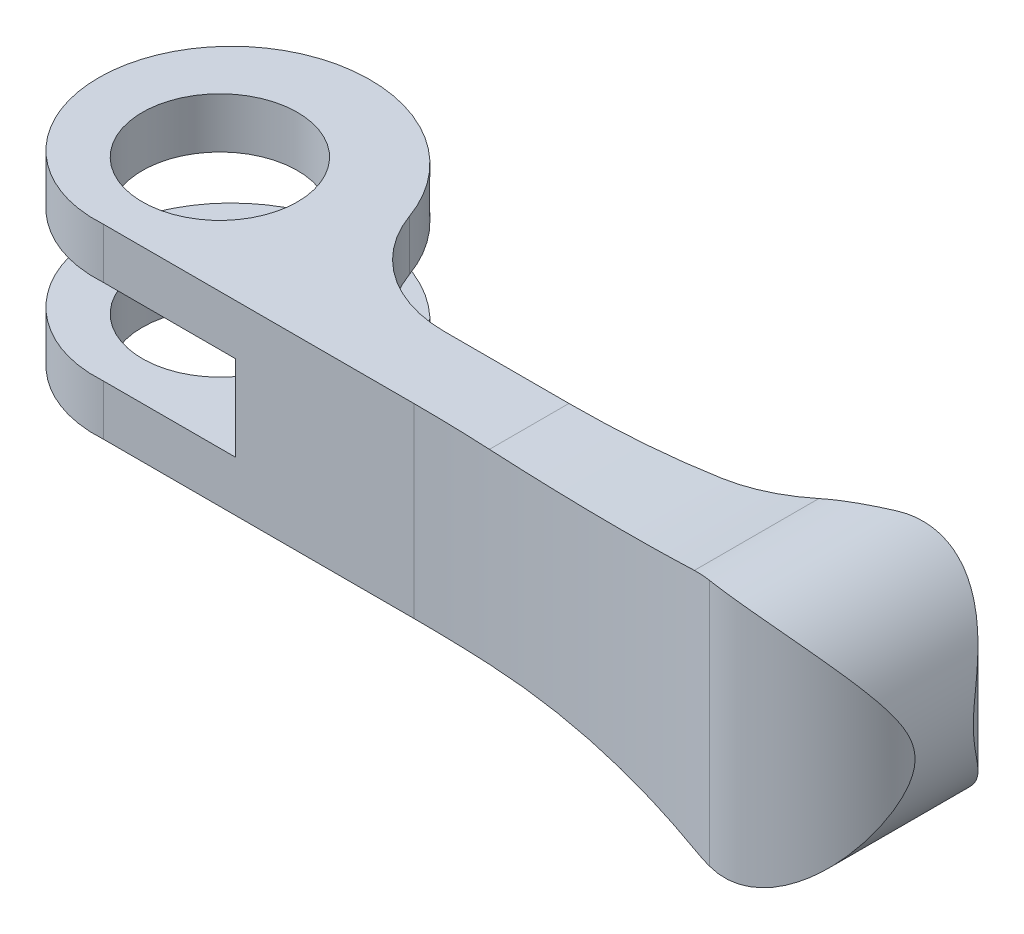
ISO-10303-21;
HEADER;
FILE_DESCRIPTION(('STEP AP214'),'2;1');
FILE_NAME('part.step','',(''),(''),'','','');
FILE_SCHEMA(('AUTOMOTIVE_DESIGN { 1 0 10303 214 1 1 1 1 }'));
ENDSEC;
DATA;
#1=APPLICATION_CONTEXT('core data for automotive mechanical design processes');
#2=APPLICATION_PROTOCOL_DEFINITION('international standard','automotive_design',2000,#1);
#3=PRODUCT_CONTEXT('',#1,'mechanical');
#4=PRODUCT('Part','Part','',(#3));
#5=PRODUCT_RELATED_PRODUCT_CATEGORY('part','',(#4));
#6=PRODUCT_DEFINITION_FORMATION('','',#4);
#7=PRODUCT_DEFINITION_CONTEXT('part definition',#1,'design');
#8=PRODUCT_DEFINITION('design','',#6,#7);
#9=PRODUCT_DEFINITION_SHAPE('','',#8);
#10=(LENGTH_UNIT() NAMED_UNIT(*) SI_UNIT(.MILLI.,.METRE.));
#11=(NAMED_UNIT(*) PLANE_ANGLE_UNIT() SI_UNIT($,.RADIAN.));
#12=(NAMED_UNIT(*) SI_UNIT($,.STERADIAN.) SOLID_ANGLE_UNIT());
#13=UNCERTAINTY_MEASURE_WITH_UNIT(LENGTH_MEASURE(1.E-05),#10,'distance_accuracy_value','');
#14=(GEOMETRIC_REPRESENTATION_CONTEXT(3) GLOBAL_UNCERTAINTY_ASSIGNED_CONTEXT((#13)) GLOBAL_UNIT_ASSIGNED_CONTEXT((#10,
#11,#12)) REPRESENTATION_CONTEXT('',''));
#15=CARTESIAN_POINT('',(0.,0.,0.));
#16=DIRECTION('',(0.,0.,1.));
#17=DIRECTION('',(1.,0.,0.));
#18=AXIS2_PLACEMENT_3D('',#15,#16,#17);
#19=CARTESIAN_POINT('',(20.,-8.,107.05));
#20=DIRECTION('',(0.,1.,0.));
#21=DIRECTION('',(1.,0.,0.));
#22=AXIS2_PLACEMENT_3D('',#19,#20,#21);
#23=CYLINDRICAL_SURFACE('',#22,99.55);
#24=CARTESIAN_POINT('',(40.1433447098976,7.7815699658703,9.55924062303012));
#25=CARTESIAN_POINT('',(40.2458941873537,7.80603937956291,9.58042855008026));
#26=CARTESIAN_POINT('',(40.3488715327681,7.82846573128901,9.60187471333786));
#27=CARTESIAN_POINT('',(40.5553761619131,7.86918752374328,9.64522558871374));
#28=CARTESIAN_POINT('',(40.6589023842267,7.88748913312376,9.66712956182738));
#29=CARTESIAN_POINT('',(40.9704289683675,7.93625939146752,9.73356333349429));
#30=CARTESIAN_POINT('',(41.1792613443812,7.96056586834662,9.7787910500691));
#31=CARTESIAN_POINT('',(41.3886034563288,7.97660292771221,9.82484820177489));
#32=B_SPLINE_CURVE_WITH_KNOTS('',3,(#24,#25,#26,#27,#28,#29,#30,#31),.UNSPECIFIED.,.F.,.F.,(4,2,
2,4),(0.,0.322577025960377,0.64466838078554,1.28921460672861),.UNSPECIFIED.);
#33=CARTESIAN_POINT('',(40.1433447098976,7.7815699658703,9.55924062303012));
#34=VERTEX_POINT('',#33);
#35=CARTESIAN_POINT('',(41.3886034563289,7.97660292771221,9.82484820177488));
#36=VERTEX_POINT('',#35);
#37=EDGE_CURVE('E179',#34,#36,#32,.T.);
#38=ORIENTED_EDGE('',*,*,#37,.F.);
#39=CARTESIAN_POINT('',(25.,6.,7.62564433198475));
#40=CARTESIAN_POINT('',(25.6432150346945,5.99999671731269,7.65798661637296));
#41=CARTESIAN_POINT('',(26.2860644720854,6.00951199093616,7.69657845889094));
#42=CARTESIAN_POINT('',(27.5703265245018,6.04748034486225,7.78617549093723));
#43=CARTESIAN_POINT('',(28.2117391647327,6.07593309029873,7.83718046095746));
#44=CARTESIAN_POINT('',(30.1265504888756,6.18917961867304,8.00813073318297));
#45=CARTESIAN_POINT('',(31.396810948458,6.30186449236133,8.14632916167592));
#46=CARTESIAN_POINT('',(33.9225081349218,6.60041769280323,8.47014726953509));
#47=CARTESIAN_POINT('',(35.1779454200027,6.78628325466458,8.65576515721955));
#48=CARTESIAN_POINT('',(37.0486962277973,7.11891974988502,8.96867057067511));
#49=CARTESIAN_POINT('',(37.6717158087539,7.23913092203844,9.07903027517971));
#50=CARTESIAN_POINT('',(38.9119872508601,7.49719375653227,9.31087118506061));
#51=CARTESIAN_POINT('',(39.5292392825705,7.63504489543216,9.43235206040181));
#52=CARTESIAN_POINT('',(40.1433447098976,7.7815699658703,9.55924062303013));
#53=B_SPLINE_CURVE_WITH_KNOTS('',3,(#39,#40,#41,#42,#43,#44,#45,#46,#47,#48,#49,#50,#51,#52),
.UNSPECIFIED.,.F.,.F.,(4,2,2,2,2,2,4),(0.,1.93188145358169,3.86372874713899,7.70857673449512,
11.5532794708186,13.4850725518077,15.416808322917),.UNSPECIFIED.);
#54=CARTESIAN_POINT('',(25.,6.,7.62564433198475));
#55=VERTEX_POINT('',#54);
#56=EDGE_CURVE('E145',#55,#34,#53,.T.);
#57=ORIENTED_EDGE('',*,*,#56,.F.);
#58=CARTESIAN_POINT('',(20.,6.,107.05));
#59=DIRECTION('',(0.,1.,0.));
#60=DIRECTION('',(1.,0.,0.));
#61=AXIS2_PLACEMENT_3D('',#58,#59,#60);
#62=CIRCLE('',#61,99.55);
#63=CARTESIAN_POINT('',(20.,6.,7.5));
#64=VERTEX_POINT('',#63);
#65=EDGE_CURVE('E154',#64,#55,#62,.F.);
#66=ORIENTED_EDGE('',*,*,#65,.F.);
#67=DIRECTION('',(0.,1.,0.));
#68=VECTOR('',#67,1.);
#69=CARTESIAN_POINT('',(20.,-8.,7.5));
#70=LINE('',#69,#68);
#71=CARTESIAN_POINT('',(20.,-6.,7.5));
#72=VERTEX_POINT('',#71);
#73=EDGE_CURVE('E301',#72,#64,#70,.T.);
#74=ORIENTED_EDGE('',*,*,#73,.F.);
#75=CARTESIAN_POINT('',(20.,-6.,107.05));
#76=DIRECTION('',(0.,1.,0.));
#77=DIRECTION('',(1.,0.,0.));
#78=AXIS2_PLACEMENT_3D('',#75,#76,#77);
#79=CIRCLE('',#78,99.55);
#80=CARTESIAN_POINT('',(25.,-6.,7.62564433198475));
#81=VERTEX_POINT('',#80);
#82=EDGE_CURVE('E522',#72,#81,#79,.F.);
#83=ORIENTED_EDGE('',*,*,#82,.T.);
#84=CARTESIAN_POINT('',(25.,-6.,7.62564433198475));
#85=CARTESIAN_POINT('',(25.6432150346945,-5.99999671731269,7.65798661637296));
#86=CARTESIAN_POINT('',(26.2860644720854,-6.00951199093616,7.69657845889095));
#87=CARTESIAN_POINT('',(27.5703265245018,-6.04748034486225,7.78617549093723));
#88=CARTESIAN_POINT('',(28.2117391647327,-6.07593309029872,7.83718046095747));
#89=CARTESIAN_POINT('',(30.1265504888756,-6.18917961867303,8.00813073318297));
#90=CARTESIAN_POINT('',(31.396810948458,-6.30186449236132,8.14632916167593));
#91=CARTESIAN_POINT('',(33.9225081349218,-6.60041769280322,8.4701472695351));
#92=CARTESIAN_POINT('',(35.1779454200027,-6.78628325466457,8.65576515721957));
#93=CARTESIAN_POINT('',(37.0486962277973,-7.11891974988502,8.96867057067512));
#94=CARTESIAN_POINT('',(37.6717158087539,-7.23913092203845,9.07903027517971));
#95=CARTESIAN_POINT('',(38.9119872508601,-7.49719375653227,9.3108711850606));
#96=CARTESIAN_POINT('',(39.5292392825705,-7.63504489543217,9.43235206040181));
#97=CARTESIAN_POINT('',(40.1433447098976,-7.78156996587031,9.55924062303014));
#98=B_SPLINE_CURVE_WITH_KNOTS('',3,(#84,#85,#86,#87,#88,#89,#90,#91,#92,#93,#94,#95,#96,#97),
.UNSPECIFIED.,.F.,.F.,(4,2,2,2,2,2,4),(0.,1.93188145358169,3.86372874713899,7.70857673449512,
11.5532794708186,13.4850725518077,15.416808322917),.UNSPECIFIED.);
#99=CARTESIAN_POINT('',(40.1433447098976,-7.7815699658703,9.55924062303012));
#100=VERTEX_POINT('',#99);
#101=EDGE_CURVE('E516',#81,#100,#98,.T.);
#102=ORIENTED_EDGE('',*,*,#101,.T.);
#103=CARTESIAN_POINT('',(40.1433447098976,-7.7815699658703,9.55924062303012));
#104=CARTESIAN_POINT('',(40.2458941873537,-7.80603937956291,9.58042855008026));
#105=CARTESIAN_POINT('',(40.3488715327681,-7.82846573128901,9.60187471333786));
#106=CARTESIAN_POINT('',(40.5553761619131,-7.86918752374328,9.64522558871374));
#107=CARTESIAN_POINT('',(40.6589023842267,-7.88748913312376,9.66712956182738));
#108=CARTESIAN_POINT('',(40.9704289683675,-7.93625939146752,9.73356333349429));
#109=CARTESIAN_POINT('',(41.1792613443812,-7.96056586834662,9.7787910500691));
#110=CARTESIAN_POINT('',(41.3886034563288,-7.97660292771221,9.82484820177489));
#111=B_SPLINE_CURVE_WITH_KNOTS('',3,(#103,#104,#105,#106,#107,#108,#109,#110),.UNSPECIFIED.,.F.,
.F.,(4,2,2,4),(0.,0.322577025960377,0.64466838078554,1.28921460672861),.UNSPECIFIED.);
#112=CARTESIAN_POINT('',(41.3886034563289,-7.97660292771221,9.82484820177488));
#113=VERTEX_POINT('',#112);
#114=EDGE_CURVE('E222',#100,#113,#111,.T.);
#115=ORIENTED_EDGE('',*,*,#114,.T.);
#116=DIRECTION('',(0.,1.,0.));
#117=VECTOR('',#116,1.);
#118=CARTESIAN_POINT('',(41.3886034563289,-8.,9.82484820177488));
#119=LINE('',#118,#117);
#120=EDGE_CURVE('E284',#113,#36,#119,.T.);
#121=ORIENTED_EDGE('',*,*,#120,.T.);
#122=EDGE_LOOP('',(#38,#57,#66,#74,#83,#102,#115,#121));
#123=FACE_BOUND('',#122,.T.);
#124=ADVANCED_FACE('F14',(#123),#23,.F.);
#125=CARTESIAN_POINT('',(0.,-8.,7.5));
#126=DIRECTION('',(0.,0.,-1.));
#127=DIRECTION('',(1.,0.,0.));
#128=AXIS2_PLACEMENT_3D('',#125,#126,#127);
#129=PLANE('',#128);
#130=DIRECTION('',(1.,0.,0.));
#131=VECTOR('',#130,1.);
#132=CARTESIAN_POINT('',(0.,6.,7.5));
#133=LINE('',#132,#131);
#134=CARTESIAN_POINT('',(0.,6.,7.5));
#135=VERTEX_POINT('',#134);
#136=EDGE_CURVE('E164',#135,#64,#133,.T.);
#137=ORIENTED_EDGE('',*,*,#136,.F.);
#138=DIRECTION('',(0.,1.,0.));
#139=VECTOR('',#138,1.);
#140=CARTESIAN_POINT('',(0.,-8.,7.5));
#141=LINE('',#140,#139);
#142=CARTESIAN_POINT('',(0.,2.75,7.5));
#143=VERTEX_POINT('',#142);
#144=EDGE_CURVE('E292',#143,#135,#141,.T.);
#145=ORIENTED_EDGE('',*,*,#144,.F.);
#146=DIRECTION('',(1.,0.,0.));
#147=VECTOR('',#146,1.);
#148=CARTESIAN_POINT('',(0.,2.75,7.5));
#149=LINE('',#148,#147);
#150=CARTESIAN_POINT('',(8.5,2.75,7.5));
#151=VERTEX_POINT('',#150);
#152=EDGE_CURVE('E42',#143,#151,#149,.T.);
#153=ORIENTED_EDGE('',*,*,#152,.T.);
#154=DIRECTION('',(0.,-1.,0.));
#155=VECTOR('',#154,1.);
#156=CARTESIAN_POINT('',(8.5,-8.,7.5));
#157=LINE('',#156,#155);
#158=CARTESIAN_POINT('',(8.5,-2.75,7.5));
#159=VERTEX_POINT('',#158);
#160=EDGE_CURVE('E365',#151,#159,#157,.T.);
#161=ORIENTED_EDGE('',*,*,#160,.T.);
#162=DIRECTION('',(-1.,0.,0.));
#163=VECTOR('',#162,1.);
#164=CARTESIAN_POINT('',(0.,-2.75,7.5));
#165=LINE('',#164,#163);
#166=CARTESIAN_POINT('',(0.,-2.75,7.5));
#167=VERTEX_POINT('',#166);
#168=EDGE_CURVE('E359',#159,#167,#165,.T.);
#169=ORIENTED_EDGE('',*,*,#168,.T.);
#170=CARTESIAN_POINT('',(0.,-6.,7.5));
#171=VERTEX_POINT('',#170);
#172=EDGE_CURVE('E296',#171,#167,#141,.T.);
#173=ORIENTED_EDGE('',*,*,#172,.F.);
#174=DIRECTION('',(1.,0.,0.));
#175=VECTOR('',#174,1.);
#176=CARTESIAN_POINT('',(0.,-6.,7.5));
#177=LINE('',#176,#175);
#178=EDGE_CURVE('E524',#171,#72,#177,.T.);
#179=ORIENTED_EDGE('',*,*,#178,.T.);
#180=ORIENTED_EDGE('',*,*,#73,.T.);
#181=EDGE_LOOP('',(#137,#145,#153,#161,#169,#173,#179,#180));
#182=FACE_BOUND('',#181,.T.);
#183=ADVANCED_FACE('F273',(#182),#129,.F.);
#184=CARTESIAN_POINT('',(0.,-8.,7.5));
#185=CARTESIAN_POINT('',(-0.98174770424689,-8.,7.56864583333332));
#186=CARTESIAN_POINT('',(-1.99074321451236,-8.,7.44195209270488));
#187=CARTESIAN_POINT('',(-3.90712600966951,-8.,6.79676377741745));
#188=CARTESIAN_POINT('',(-4.81367689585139,-8.,6.27832416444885));
#189=CARTESIAN_POINT('',(-6.37540403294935,-8.,4.91075676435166));
#190=CARTESIAN_POINT('',(-7.02981358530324,-8.,4.06201483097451));
#191=CARTESIAN_POINT('',(-7.96994804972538,-8.,2.15108987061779));
#192=CARTESIAN_POINT('',(-8.25510416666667,-8.,1.0895763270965));
#193=CARTESIAN_POINT('',(-8.39239583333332,-8.,-1.08957632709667));
#194=CARTESIAN_POINT('',(-8.2442620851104,-8.,-2.20635803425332));
#195=CARTESIAN_POINT('',(-7.51654531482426,-8.,-4.32198214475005));
#196=CARTESIAN_POINT('',(-6.93704972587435,-8.,-5.31990975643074));
#197=CARTESIAN_POINT('',(-5.41698962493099,-8.,-7.03412959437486));
#198=CARTESIAN_POINT('',(-4.47687096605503,-8.,-7.74959512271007));
#199=CARTESIAN_POINT('',(-2.36670469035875,-8.,-8.77225804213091));
#200=CARTESIAN_POINT('',(-1.19740494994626,-8.,-9.07885416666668));
#201=CARTESIAN_POINT('',(1.19740494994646,-8.,-9.21614583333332));
#202=CARTESIAN_POINT('',(2.42197285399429,-8.,-9.04657207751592));
#203=CARTESIAN_POINT('',(4.73683827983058,-8.,-8.23632685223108));
#204=CARTESIAN_POINT('',(5.82614261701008,-8.,-7.59577528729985));
#205=CARTESIAN_POINT('',(7.69285515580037,-8.,-5.92322248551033));
#206=CARTESIAN_POINT('',(8.46937666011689,-8.,-4.89172710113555));
#207=CARTESIAN_POINT('',(9.57456803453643,-8.,-2.5823195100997));
#208=CARTESIAN_POINT('',(9.90260416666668,-8.,-1.30523357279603));
#209=CARTESIAN_POINT('',(10.0398958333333,-8.,1.30523357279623));
#210=CARTESIAN_POINT('',(9.84888206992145,-8.,2.63758767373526));
#211=CARTESIAN_POINT('',(8.95610838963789,-8.,5.15169441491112));
#212=CARTESIAN_POINT('',(8.25450084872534,-8.,6.33237547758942));
#213=CARTESIAN_POINT('',(6.42945534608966,-8.,8.35158071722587));
#214=CARTESIAN_POINT('',(5.30658323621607,-8.,9.18915819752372));
#215=CARTESIAN_POINT('',(2.79793432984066,-8.,10.376878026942));
#216=CARTESIAN_POINT('',(1.4130621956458,-8.,10.7263541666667));
#217=CARTESIAN_POINT('',(-1.10427610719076E-13,-8.,10.795));
#218=B_SPLINE_CURVE_WITH_KNOTS('',3,(#184,#185,#186,#187,#188,#189,#190,#191,#192,#193,#194,
#195,#196,#197,#198,#199,#200,#201,#202,#203,#204,#205,#206,#207,#208,#209,#210,#211,#212,#213,
#214,#215,#216,#217),.UNSPECIFIED.,.F.,.F.,(4,2,2,2,2,2,2,2,2,2,2,2,2,2,2,2,4),(0.,0.0625,0.125,
0.1875,0.25,0.3125,0.375,0.4375,0.5,0.5625,0.625,0.6875,0.75,0.8125,0.875,0.9375,1.),.UNSPECIFIED.);
#219=DIRECTION('',(0.,1.,0.));
#220=VECTOR('',#219,1.);
#221=SURFACE_OF_LINEAR_EXTRUSION('',#218,#220);
#222=CARTESIAN_POINT('',(0.,6.,7.5));
#223=CARTESIAN_POINT('',(-0.98174770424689,6.,7.56864583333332));
#224=CARTESIAN_POINT('',(-1.99074321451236,6.,7.44195209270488));
#225=CARTESIAN_POINT('',(-3.90712600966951,6.,6.79676377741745));
#226=CARTESIAN_POINT('',(-4.81367689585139,6.,6.27832416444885));
#227=CARTESIAN_POINT('',(-6.37540403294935,6.,4.91075676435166));
#228=CARTESIAN_POINT('',(-7.02981358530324,6.,4.06201483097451));
#229=CARTESIAN_POINT('',(-7.96994804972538,6.,2.15108987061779));
#230=CARTESIAN_POINT('',(-8.25510416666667,6.,1.0895763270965));
#231=CARTESIAN_POINT('',(-8.39239583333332,6.,-1.08957632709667));
#232=CARTESIAN_POINT('',(-8.2442620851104,6.,-2.20635803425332));
#233=CARTESIAN_POINT('',(-7.51654531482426,6.,-4.32198214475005));
#234=CARTESIAN_POINT('',(-6.93704972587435,6.,-5.31990975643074));
#235=CARTESIAN_POINT('',(-5.41698962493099,6.,-7.03412959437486));
#236=CARTESIAN_POINT('',(-4.47687096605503,6.,-7.74959512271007));
#237=CARTESIAN_POINT('',(-2.36670469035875,6.,-8.77225804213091));
#238=CARTESIAN_POINT('',(-1.19740494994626,6.,-9.07885416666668));
#239=CARTESIAN_POINT('',(1.19740494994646,6.,-9.21614583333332));
#240=CARTESIAN_POINT('',(2.42197285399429,6.,-9.04657207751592));
#241=CARTESIAN_POINT('',(4.73683827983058,6.,-8.23632685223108));
#242=CARTESIAN_POINT('',(5.82614261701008,6.,-7.59577528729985));
#243=CARTESIAN_POINT('',(7.69285515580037,6.,-5.92322248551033));
#244=CARTESIAN_POINT('',(8.46937666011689,6.,-4.89172710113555));
#245=CARTESIAN_POINT('',(9.57456803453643,6.,-2.5823195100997));
#246=CARTESIAN_POINT('',(9.90260416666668,6.,-1.30523357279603));
#247=CARTESIAN_POINT('',(10.0398958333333,6.,1.30523357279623));
#248=CARTESIAN_POINT('',(9.84888206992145,6.,2.63758767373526));
#249=CARTESIAN_POINT('',(8.95610838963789,6.,5.15169441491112));
#250=CARTESIAN_POINT('',(8.25450084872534,6.,6.33237547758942));
#251=CARTESIAN_POINT('',(6.42945534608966,6.,8.35158071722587));
#252=CARTESIAN_POINT('',(5.30658323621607,6.,9.18915819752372));
#253=CARTESIAN_POINT('',(2.79793432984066,6.,10.376878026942));
#254=CARTESIAN_POINT('',(1.4130621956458,6.,10.7263541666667));
#255=CARTESIAN_POINT('',(-1.10427610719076E-13,6.,10.795));
#256=B_SPLINE_CURVE_WITH_KNOTS('',3,(#222,#223,#224,#225,#226,#227,#228,#229,#230,#231,#232,
#233,#234,#235,#236,#237,#238,#239,#240,#241,#242,#243,#244,#245,#246,#247,#248,#249,#250,#251,
#252,#253,#254,#255),.UNSPECIFIED.,.F.,.F.,(4,2,2,2,2,2,2,2,2,2,2,2,2,2,2,2,4),(0.,0.0625,0.125,
0.1875,0.25,0.3125,0.375,0.4375,0.5,0.5625,0.625,0.6875,0.75,0.8125,0.875,0.9375,1.),.UNSPECIFIED.);
#257=CARTESIAN_POINT('',(9.40828544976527,6.,-2.80915881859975));
#258=VERTEX_POINT('',#257);
#259=EDGE_CURVE('E162',#258,#135,#256,.F.);
#260=ORIENTED_EDGE('',*,*,#259,.F.);
#261=DIRECTION('',(0.,1.,0.));
#262=VECTOR('',#261,1.);
#263=CARTESIAN_POINT('',(9.40828544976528,8.,-2.80915881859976));
#264=LINE('',#263,#262);
#265=CARTESIAN_POINT('',(9.40828544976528,2.75,-2.80915881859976));
#266=VERTEX_POINT('',#265);
#267=EDGE_CURVE('E35',#258,#266,#264,.F.);
#268=ORIENTED_EDGE('',*,*,#267,.T.);
#269=CARTESIAN_POINT('',(0.,2.75,7.5));
#270=CARTESIAN_POINT('',(-0.98174770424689,2.75,7.56864583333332));
#271=CARTESIAN_POINT('',(-1.99074321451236,2.75,7.44195209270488));
#272=CARTESIAN_POINT('',(-3.90712600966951,2.75,6.79676377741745));
#273=CARTESIAN_POINT('',(-4.81367689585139,2.75,6.27832416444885));
#274=CARTESIAN_POINT('',(-6.37540403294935,2.75,4.91075676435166));
#275=CARTESIAN_POINT('',(-7.02981358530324,2.75,4.06201483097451));
#276=CARTESIAN_POINT('',(-7.96994804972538,2.75,2.15108987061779));
#277=CARTESIAN_POINT('',(-8.25510416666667,2.75,1.0895763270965));
#278=CARTESIAN_POINT('',(-8.39239583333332,2.75,-1.08957632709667));
#279=CARTESIAN_POINT('',(-8.2442620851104,2.75,-2.20635803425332));
#280=CARTESIAN_POINT('',(-7.51654531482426,2.75,-4.32198214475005));
#281=CARTESIAN_POINT('',(-6.93704972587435,2.75,-5.31990975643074));
#282=CARTESIAN_POINT('',(-5.41698962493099,2.75,-7.03412959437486));
#283=CARTESIAN_POINT('',(-4.47687096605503,2.75,-7.74959512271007));
#284=CARTESIAN_POINT('',(-2.36670469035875,2.75,-8.77225804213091));
#285=CARTESIAN_POINT('',(-1.19740494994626,2.75,-9.07885416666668));
#286=CARTESIAN_POINT('',(1.19740494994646,2.75,-9.21614583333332));
#287=CARTESIAN_POINT('',(2.42197285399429,2.75,-9.04657207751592));
#288=CARTESIAN_POINT('',(4.73683827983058,2.75,-8.23632685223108));
#289=CARTESIAN_POINT('',(5.82614261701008,2.75,-7.59577528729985));
#290=CARTESIAN_POINT('',(7.69285515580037,2.75,-5.92322248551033));
#291=CARTESIAN_POINT('',(8.46937666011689,2.75,-4.89172710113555));
#292=CARTESIAN_POINT('',(9.57456803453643,2.75,-2.5823195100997));
#293=CARTESIAN_POINT('',(9.90260416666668,2.75,-1.30523357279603));
#294=CARTESIAN_POINT('',(10.0398958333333,2.75,1.30523357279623));
#295=CARTESIAN_POINT('',(9.84888206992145,2.75,2.63758767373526));
#296=CARTESIAN_POINT('',(8.95610838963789,2.75,5.15169441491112));
#297=CARTESIAN_POINT('',(8.25450084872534,2.75,6.33237547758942));
#298=CARTESIAN_POINT('',(6.42945534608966,2.75,8.35158071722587));
#299=CARTESIAN_POINT('',(5.30658323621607,2.75,9.18915819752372));
#300=CARTESIAN_POINT('',(2.79793432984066,2.75,10.376878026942));
#301=CARTESIAN_POINT('',(1.4130621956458,2.75,10.7263541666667));
#302=CARTESIAN_POINT('',(-1.10427610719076E-13,2.75,10.795));
#303=B_SPLINE_CURVE_WITH_KNOTS('',3,(#269,#270,#271,#272,#273,#274,#275,#276,#277,#278,#279,
#280,#281,#282,#283,#284,#285,#286,#287,#288,#289,#290,#291,#292,#293,#294,#295,#296,#297,#298,
#299,#300,#301,#302),.UNSPECIFIED.,.F.,.F.,(4,2,2,2,2,2,2,2,2,2,2,2,2,2,2,2,4),(0.,0.0625,0.125,
0.1875,0.25,0.3125,0.375,0.4375,0.5,0.5625,0.625,0.6875,0.75,0.8125,0.875,0.9375,1.),.UNSPECIFIED.);
#304=EDGE_CURVE('E307',#266,#143,#303,.F.);
#305=ORIENTED_EDGE('',*,*,#304,.T.);
#306=ORIENTED_EDGE('',*,*,#144,.T.);
#307=EDGE_LOOP('',(#260,#268,#305,#306));
#308=FACE_BOUND('',#307,.T.);
#309=ADVANCED_FACE('F278',(#308),#221,.F.);
#310=CARTESIAN_POINT('',(9.7876235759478,-8.,2.5));
#311=DIRECTION('',(0.,0.,1.));
#312=DIRECTION('',(-1.,0.,0.));
#313=AXIS2_PLACEMENT_3D('',#310,#311,#312);
#314=PLANE('',#313);
#315=CARTESIAN_POINT('',(25.,71.25,2.5));
#316=DIRECTION('',(0.,0.,1.));
#317=DIRECTION('',(-1.,0.,0.));
#318=AXIS2_PLACEMENT_3D('',#315,#316,#317);
#319=CIRCLE('',#318,65.25);
#320=CARTESIAN_POINT('',(34.853251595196,6.7482486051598,2.5));
#321=VERTEX_POINT('',#320);
#322=CARTESIAN_POINT('',(25.,6.,2.5));
#323=VERTEX_POINT('',#322);
#324=EDGE_CURVE('E134',#321,#323,#319,.F.);
#325=ORIENTED_EDGE('',*,*,#324,.F.);
#326=DIRECTION('',(0.,1.,0.));
#327=VECTOR('',#326,1.);
#328=CARTESIAN_POINT('',(34.853251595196,-8.,2.5));
#329=LINE('',#328,#327);
#330=CARTESIAN_POINT('',(34.853251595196,-6.74824860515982,2.5));
#331=VERTEX_POINT('',#330);
#332=EDGE_CURVE('E288',#331,#321,#329,.T.);
#333=ORIENTED_EDGE('',*,*,#332,.F.);
#334=CARTESIAN_POINT('',(25.,-71.25,2.5));
#335=DIRECTION('',(0.,0.,1.));
#336=DIRECTION('',(-1.,0.,0.));
#337=AXIS2_PLACEMENT_3D('',#334,#335,#336);
#338=CIRCLE('',#337,65.25);
#339=CARTESIAN_POINT('',(25.,-6.,2.5));
#340=VERTEX_POINT('',#339);
#341=EDGE_CURVE('E257',#331,#340,#338,.T.);
#342=ORIENTED_EDGE('',*,*,#341,.T.);
#343=DIRECTION('',(-1.,0.,0.));
#344=VECTOR('',#343,1.);
#345=CARTESIAN_POINT('',(9.7876235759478,-6.,2.5));
#346=LINE('',#345,#344);
#347=CARTESIAN_POINT('',(16.9421671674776,-6.,2.5));
#348=VERTEX_POINT('',#347);
#349=EDGE_CURVE('E328',#340,#348,#346,.T.);
#350=ORIENTED_EDGE('',*,*,#349,.T.);
#351=DIRECTION('',(0.,-1.,0.));
#352=VECTOR('',#351,1.);
#353=CARTESIAN_POINT('',(16.9421671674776,8.,2.5));
#354=LINE('',#353,#352);
#355=CARTESIAN_POINT('',(16.9421671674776,-2.75,2.5));
#356=VERTEX_POINT('',#355);
#357=EDGE_CURVE('E313',#348,#356,#354,.F.);
#358=ORIENTED_EDGE('',*,*,#357,.T.);
#359=DIRECTION('',(-1.,0.,0.));
#360=VECTOR('',#359,1.);
#361=CARTESIAN_POINT('',(18.5,-2.75,2.5));
#362=LINE('',#361,#360);
#363=CARTESIAN_POINT('',(8.5,-2.75,2.5));
#364=VERTEX_POINT('',#363);
#365=EDGE_CURVE('E339',#356,#364,#362,.T.);
#366=ORIENTED_EDGE('',*,*,#365,.T.);
#367=DIRECTION('',(0.,1.,0.));
#368=VECTOR('',#367,1.);
#369=CARTESIAN_POINT('',(8.5,-2.75,2.5));
#370=LINE('',#369,#368);
#371=CARTESIAN_POINT('',(8.5,2.75,2.5));
#372=VERTEX_POINT('',#371);
#373=EDGE_CURVE('E337',#364,#372,#370,.T.);
#374=ORIENTED_EDGE('',*,*,#373,.T.);
#375=DIRECTION('',(-1.,0.,0.));
#376=VECTOR('',#375,1.);
#377=CARTESIAN_POINT('',(18.5,2.75,2.5));
#378=LINE('',#377,#376);
#379=CARTESIAN_POINT('',(16.9421671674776,2.75,2.5));
#380=VERTEX_POINT('',#379);
#381=EDGE_CURVE('E334',#380,#372,#378,.T.);
#382=ORIENTED_EDGE('',*,*,#381,.F.);
#383=CARTESIAN_POINT('',(16.9421671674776,6.,2.5000000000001));
#384=VERTEX_POINT('',#383);
#385=EDGE_CURVE('E161',#380,#384,#354,.F.);
#386=ORIENTED_EDGE('',*,*,#385,.T.);
#387=DIRECTION('',(-1.,0.,0.));
#388=VECTOR('',#387,1.);
#389=CARTESIAN_POINT('',(9.78762357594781,6.,2.5));
#390=LINE('',#389,#388);
#391=EDGE_CURVE('E151',#323,#384,#390,.T.);
#392=ORIENTED_EDGE('',*,*,#391,.F.);
#393=EDGE_LOOP('',(#325,#333,#342,#350,#358,#366,#374,#382,#386,#392));
#394=FACE_BOUND('',#393,.T.);
#395=ADVANCED_FACE('F158',(#394),#314,.F.);
#396=CARTESIAN_POINT('',(34.853251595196,-8.,-12.5));
#397=DIRECTION('',(0.,1.,0.));
#398=DIRECTION('',(1.,0.,0.));
#399=AXIS2_PLACEMENT_3D('',#396,#397,#398);
#400=CYLINDRICAL_SURFACE('',#399,15.);
#401=CARTESIAN_POINT('',(43.4276734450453,7.8715785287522,-0.192307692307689));
#402=CARTESIAN_POINT('',(43.2330964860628,7.90688424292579,-0.0567088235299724));
#403=CARTESIAN_POINT('',(43.0343618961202,7.93546031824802,0.0748476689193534));
#404=CARTESIAN_POINT('',(42.6294150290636,7.97779975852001,0.329195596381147));
#405=CARTESIAN_POINT('',(42.4231916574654,7.99154013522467,0.451973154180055));
#406=CARTESIAN_POINT('',(42.0087624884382,8.00262854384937,0.685377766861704));
#407=CARTESIAN_POINT('',(41.8006722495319,8.00028859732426,0.796193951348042));
#408=CARTESIAN_POINT('',(41.3803562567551,7.9787378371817,1.00748429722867));
#409=CARTESIAN_POINT('',(41.1681347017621,7.95954335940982,1.10796836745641));
#410=CARTESIAN_POINT('',(40.820522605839,7.91373229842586,1.26274941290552));
#411=CARTESIAN_POINT('',(40.6858632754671,7.8925180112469,1.32034222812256));
#412=CARTESIAN_POINT('',(40.4152492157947,7.84267986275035,1.43146636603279));
#413=CARTESIAN_POINT('',(40.2792916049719,7.81401139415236,1.48497063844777));
#414=CARTESIAN_POINT('',(40.1433447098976,7.7815699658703,1.53620015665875));
#415=B_SPLINE_CURVE_WITH_KNOTS('',3,(#401,#402,#403,#404,#405,#406,#407,#408,#409,#410,#411,
#412,#413,#414),.UNSPECIFIED.,.F.,.F.,(4,2,2,2,2,2,4),(0.,0.7193207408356,1.43975449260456,
2.14624901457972,2.85205953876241,3.29579458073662,3.74224871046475),.UNSPECIFIED.);
#416=CARTESIAN_POINT('',(43.4276734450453,7.8715785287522,-0.192307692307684));
#417=VERTEX_POINT('',#416);
#418=CARTESIAN_POINT('',(40.1433447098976,7.7815699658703,1.53620015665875));
#419=VERTEX_POINT('',#418);
#420=EDGE_CURVE('E146',#417,#419,#415,.T.);
#421=ORIENTED_EDGE('',*,*,#420,.F.);
#422=DIRECTION('',(0.,1.,0.));
#423=VECTOR('',#422,1.);
#424=CARTESIAN_POINT('',(43.4276734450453,-8.,-0.192307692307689));
#425=LINE('',#424,#423);
#426=CARTESIAN_POINT('',(43.4276734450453,-7.8715785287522,-0.192307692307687));
#427=VERTEX_POINT('',#426);
#428=EDGE_CURVE('E293',#427,#417,#425,.T.);
#429=ORIENTED_EDGE('',*,*,#428,.F.);
#430=CARTESIAN_POINT('',(43.4276734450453,-7.8715785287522,-0.192307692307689));
#431=CARTESIAN_POINT('',(43.2330964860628,-7.90688424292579,-0.0567088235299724));
#432=CARTESIAN_POINT('',(43.0343618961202,-7.93546031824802,0.0748476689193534));
#433=CARTESIAN_POINT('',(42.6294150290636,-7.97779975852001,0.329195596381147));
#434=CARTESIAN_POINT('',(42.4231916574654,-7.99154013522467,0.451973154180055));
#435=CARTESIAN_POINT('',(42.0087624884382,-8.00262854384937,0.685377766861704));
#436=CARTESIAN_POINT('',(41.8006722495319,-8.00028859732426,0.796193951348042));
#437=CARTESIAN_POINT('',(41.3803562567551,-7.9787378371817,1.00748429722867));
#438=CARTESIAN_POINT('',(41.1681347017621,-7.95954335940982,1.10796836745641));
#439=CARTESIAN_POINT('',(40.820522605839,-7.91373229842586,1.26274941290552));
#440=CARTESIAN_POINT('',(40.6858632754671,-7.8925180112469,1.32034222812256));
#441=CARTESIAN_POINT('',(40.4152492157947,-7.84267986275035,1.43146636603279));
#442=CARTESIAN_POINT('',(40.2792916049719,-7.81401139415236,1.48497063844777));
#443=CARTESIAN_POINT('',(40.1433447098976,-7.7815699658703,1.53620015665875));
#444=B_SPLINE_CURVE_WITH_KNOTS('',3,(#430,#431,#432,#433,#434,#435,#436,#437,#438,#439,#440,
#441,#442,#443),.UNSPECIFIED.,.F.,.F.,(4,2,2,2,2,2,4),(0.,0.7193207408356,1.43975449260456,
2.14624901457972,2.85205953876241,3.29579458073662,3.74224871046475),.UNSPECIFIED.);
#445=CARTESIAN_POINT('',(40.1433447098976,-7.7815699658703,1.53620015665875));
#446=VERTEX_POINT('',#445);
#447=EDGE_CURVE('E223',#427,#446,#444,.T.);
#448=ORIENTED_EDGE('',*,*,#447,.T.);
#449=CARTESIAN_POINT('',(40.1433447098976,-7.7815699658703,1.53620015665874));
#450=CARTESIAN_POINT('',(39.7226989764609,-7.68115987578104,1.69478191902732));
#451=CARTESIAN_POINT('',(39.2943354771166,-7.58341808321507,1.83458508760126));
#452=CARTESIAN_POINT('',(38.4289272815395,-7.3953258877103,2.07443745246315));
#453=CARTESIAN_POINT('',(37.9919803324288,-7.30492227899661,2.1747978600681));
#454=CARTESIAN_POINT('',(37.1092559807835,-7.13189825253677,2.33616373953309));
#455=CARTESIAN_POINT('',(36.6634781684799,-7.04927819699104,2.39716738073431));
#456=CARTESIAN_POINT('',(35.98921672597,-6.93163307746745,2.45864735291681));
#457=CARTESIAN_POINT('',(35.7625819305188,-6.89332037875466,2.47413735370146));
#458=CARTESIAN_POINT('',(35.3084550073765,-6.81901948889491,2.49481404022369));
#459=CARTESIAN_POINT('',(35.0809628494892,-6.78303138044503,2.50000035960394));
#460=CARTESIAN_POINT('',(34.8532515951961,-6.74824860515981,2.5));
#461=B_SPLINE_CURVE_WITH_KNOTS('',3,(#449,#450,#451,#452,#453,#454,#455,#456,#457,#458,#459,
#460),.UNSPECIFIED.,.F.,.F.,(4,2,2,2,2,4),(0.,1.38140175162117,2.75167395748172,
4.12200989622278,4.81291351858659,5.50384170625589),.UNSPECIFIED.);
#462=EDGE_CURVE('E290',#446,#331,#461,.T.);
#463=ORIENTED_EDGE('',*,*,#462,.T.);
#464=ORIENTED_EDGE('',*,*,#332,.T.);
#465=CARTESIAN_POINT('',(40.1433447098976,7.7815699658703,1.53620015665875));
#466=CARTESIAN_POINT('',(39.7226989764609,7.68115987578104,1.69478191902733));
#467=CARTESIAN_POINT('',(39.2943354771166,7.58341808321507,1.83458508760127));
#468=CARTESIAN_POINT('',(38.4289272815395,7.3953258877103,2.07443745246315));
#469=CARTESIAN_POINT('',(37.9919803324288,7.30492227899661,2.1747978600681));
#470=CARTESIAN_POINT('',(37.1092559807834,7.13189825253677,2.33616373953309));
#471=CARTESIAN_POINT('',(36.6634781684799,7.04927819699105,2.39716738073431));
#472=CARTESIAN_POINT('',(35.98921672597,6.93163307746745,2.45864735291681));
#473=CARTESIAN_POINT('',(35.7625819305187,6.89332037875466,2.47413735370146));
#474=CARTESIAN_POINT('',(35.3084550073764,6.81901948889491,2.49481404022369));
#475=CARTESIAN_POINT('',(35.0809628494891,6.78303138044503,2.50000035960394));
#476=CARTESIAN_POINT('',(34.853251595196,6.74824860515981,2.5));
#477=B_SPLINE_CURVE_WITH_KNOTS('',3,(#465,#466,#467,#468,#469,#470,#471,#472,#473,#474,#475,
#476),.UNSPECIFIED.,.F.,.F.,(4,2,2,2,2,4),(0.,1.38140175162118,2.75167395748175,
4.12200989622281,4.81291351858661,5.50384170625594),.UNSPECIFIED.);
#478=EDGE_CURVE('E9',#419,#321,#477,.T.);
#479=ORIENTED_EDGE('',*,*,#478,.F.);
#480=EDGE_LOOP('',(#421,#429,#448,#463,#464,#479));
#481=FACE_BOUND('',#480,.T.);
#482=ADVANCED_FACE('F190',(#481),#400,.F.);
#483=CARTESIAN_POINT('',(46.,-8.,3.5));
#484=DIRECTION('',(0.,1.,0.));
#485=DIRECTION('',(1.,0.,0.));
#486=AXIS2_PLACEMENT_3D('',#483,#484,#485);
#487=CYLINDRICAL_SURFACE('',#486,4.5);
#488=ORIENTED_EDGE('',*,*,#428,.T.);
#489=CARTESIAN_POINT('',(43.4276734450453,7.8715785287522,-0.192307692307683));
#490=CARTESIAN_POINT('',(43.5232585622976,7.85425856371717,-0.258928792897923));
#491=CARTESIAN_POINT('',(43.6211842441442,7.83468392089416,-0.321607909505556));
#492=CARTESIAN_POINT('',(43.8207460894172,7.79071577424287,-0.438804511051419));
#493=CARTESIAN_POINT('',(43.9223816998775,7.76632298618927,-0.493323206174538));
#494=CARTESIAN_POINT('',(44.1279526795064,7.71252682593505,-0.593712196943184));
#495=CARTESIAN_POINT('',(44.231875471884,7.68314677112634,-0.639620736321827));
#496=CARTESIAN_POINT('',(44.4414685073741,7.61913593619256,-0.722996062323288));
#497=CARTESIAN_POINT('',(44.5471386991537,7.58450531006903,-0.760463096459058));
#498=CARTESIAN_POINT('',(44.7592373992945,7.50994309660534,-0.826992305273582));
#499=CARTESIAN_POINT('',(44.8656658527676,7.47001188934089,-0.856055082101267));
#500=CARTESIAN_POINT('',(45.0783878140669,7.38489389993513,-0.905970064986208));
#501=CARTESIAN_POINT('',(45.1846812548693,7.33970511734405,-0.926819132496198));
#502=CARTESIAN_POINT('',(45.3962371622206,7.24424197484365,-0.960599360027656));
#503=CARTESIAN_POINT('',(45.5014995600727,7.19396727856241,-0.973529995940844));
#504=CARTESIAN_POINT('',(45.710265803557,7.0885549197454,-0.991886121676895));
#505=CARTESIAN_POINT('',(45.8137689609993,7.03341540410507,-0.997308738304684));
#506=CARTESIAN_POINT('',(46.0228790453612,6.91602811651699,-1.0012098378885));
#507=CARTESIAN_POINT('',(46.1283757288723,6.85357356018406,-0.999369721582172));
#508=CARTESIAN_POINT('',(46.3361454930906,6.72405069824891,-0.988634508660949));
#509=CARTESIAN_POINT('',(46.438417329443,6.65698064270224,-0.979736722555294));
#510=CARTESIAN_POINT('',(46.7397120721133,6.44937990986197,-0.943391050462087));
#511=CARTESIAN_POINT('',(46.9332590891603,6.30243340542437,-0.906291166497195));
#512=CARTESIAN_POINT('',(47.263606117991,6.02746951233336,-0.821561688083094));
#513=CARTESIAN_POINT('',(47.4037056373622,5.90209818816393,-0.777864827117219));
#514=CARTESIAN_POINT('',(47.6729193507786,5.64382658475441,-0.679935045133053));
#515=CARTESIAN_POINT('',(47.8020283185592,5.51092277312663,-0.625697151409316));
#516=CARTESIAN_POINT('',(48.1730975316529,5.10182618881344,-0.450019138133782));
#517=CARTESIAN_POINT('',(48.3982631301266,4.81570115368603,-0.31576738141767));
#518=CARTESIAN_POINT('',(48.7387591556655,4.31840281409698,-0.0745883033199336));
#519=CARTESIAN_POINT('',(48.8661331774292,4.11269079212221,0.0272560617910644));
#520=CARTESIAN_POINT('',(49.1011367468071,3.69213917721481,0.235408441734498));
#521=CARTESIAN_POINT('',(49.2087515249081,3.47729290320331,0.341719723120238));
#522=CARTESIAN_POINT('',(49.4043745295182,3.03857594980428,0.55364566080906));
#523=CARTESIAN_POINT('',(49.4923858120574,2.81470668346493,0.659260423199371));
#524=CARTESIAN_POINT('',(49.6486711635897,2.35717822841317,0.863029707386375));
#525=CARTESIAN_POINT('',(49.7169671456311,2.12353024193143,0.961192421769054));
#526=CARTESIAN_POINT('',(49.8330737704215,1.64425791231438,1.1401463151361));
#527=CARTESIAN_POINT('',(49.8808886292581,1.39863604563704,1.22094106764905));
#528=CARTESIAN_POINT('',(49.9354550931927,1.02202264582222,1.31743586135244));
#529=CARTESIAN_POINT('',(49.9507682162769,0.895435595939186,1.34544662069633));
#530=CARTESIAN_POINT('',(49.9753986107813,0.639885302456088,1.39123549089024));
#531=CARTESIAN_POINT('',(49.9847215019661,0.510924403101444,1.40902319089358));
#532=CARTESIAN_POINT('',(49.9939303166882,0.31797333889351,1.42670347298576));
#533=CARTESIAN_POINT('',(49.9962040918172,0.254483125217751,1.43109560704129));
#534=CARTESIAN_POINT('',(49.9992395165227,0.127333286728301,1.4369700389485));
#535=CARTESIAN_POINT('',(50.0000011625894,0.0636736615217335,1.43845233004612));
#536=CARTESIAN_POINT('',(49.9999974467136,-0.139840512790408,1.43843589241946));
#537=CARTESIAN_POINT('',(49.9963156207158,-0.279748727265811,1.43125022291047));
#538=CARTESIAN_POINT('',(49.9817438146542,-0.557876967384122,1.40334852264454));
#539=CARTESIAN_POINT('',(49.9708462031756,-0.696095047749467,1.38261816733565));
#540=CARTESIAN_POINT('',(49.9277401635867,-1.1078479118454,1.30307882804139));
#541=CARTESIAN_POINT('',(49.8851250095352,-1.37694580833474,1.22696039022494));
#542=CARTESIAN_POINT('',(49.7859735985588,-1.85091760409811,1.06616759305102));
#543=CARTESIAN_POINT('',(49.7335866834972,-2.05832238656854,0.985824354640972));
#544=CARTESIAN_POINT('',(49.6136585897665,-2.46517873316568,0.81629271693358));
#545=CARTESIAN_POINT('',(49.5461058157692,-2.66462407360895,0.727097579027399));
#546=CARTESIAN_POINT('',(49.3960507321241,-3.05656093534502,0.545209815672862));
#547=CARTESIAN_POINT('',(49.3135228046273,-3.24903985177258,0.452511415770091));
#548=CARTESIAN_POINT('',(49.1335608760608,-3.62713445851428,0.267750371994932));
#549=CARTESIAN_POINT('',(49.0361316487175,-3.81275232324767,0.175687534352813));
#550=CARTESIAN_POINT('',(48.8171048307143,-4.19275595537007,-0.0123361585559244));
#551=CARTESIAN_POINT('',(48.6941529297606,-4.38653401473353,-0.107957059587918));
#552=CARTESIAN_POINT('',(48.4298991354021,-4.76547436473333,-0.290967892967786));
#553=CARTESIAN_POINT('',(48.2885904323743,-4.95063342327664,-0.378354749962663));
#554=CARTESIAN_POINT('',(47.9879892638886,-5.31024333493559,-0.540664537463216));
#555=CARTESIAN_POINT('',(47.8287724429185,-5.48473475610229,-0.61563681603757));
#556=CARTESIAN_POINT('',(47.4920619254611,-5.82184339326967,-0.749293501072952));
#557=CARTESIAN_POINT('',(47.3145868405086,-5.98447241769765,-0.807994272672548));
#558=CARTESIAN_POINT('',(47.0247783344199,-6.22654739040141,-0.883070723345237));
#559=CARTESIAN_POINT('',(46.9183939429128,-6.31094254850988,-0.906678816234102));
#560=CARTESIAN_POINT('',(46.7005844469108,-6.47480165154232,-0.946507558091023));
#561=CARTESIAN_POINT('',(46.5891610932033,-6.55426728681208,-0.962730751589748));
#562=CARTESIAN_POINT('',(46.361791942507,-6.70772501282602,-0.986888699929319));
#563=CARTESIAN_POINT('',(46.2458480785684,-6.78171940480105,-0.994826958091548));
#564=CARTESIAN_POINT('',(46.0100790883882,-6.92374179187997,-1.00153348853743));
#565=CARTESIAN_POINT('',(45.8902538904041,-6.99176967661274,-1.00030159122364));
#566=CARTESIAN_POINT('',(45.6464744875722,-7.12197281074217,-0.987767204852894));
#567=CARTESIAN_POINT('',(45.5224917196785,-7.18408573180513,-0.976368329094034));
#568=CARTESIAN_POINT('',(45.2726750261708,-7.30127615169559,-0.942621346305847));
#569=CARTESIAN_POINT('',(45.1468409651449,-7.35635313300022,-0.920272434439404));
#570=CARTESIAN_POINT('',(44.8948384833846,-7.459115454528,-0.864087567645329));
#571=CARTESIAN_POINT('',(44.7686704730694,-7.50680750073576,-0.830262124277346));
#572=CARTESIAN_POINT('',(44.5175191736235,-7.5947221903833,-0.750835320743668));
#573=CARTESIAN_POINT('',(44.392535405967,-7.6349479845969,-0.705238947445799));
#574=CARTESIAN_POINT('',(44.1230974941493,-7.7146312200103,-0.592938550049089));
#575=CARTESIAN_POINT('',(43.9791700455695,-7.75265787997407,-0.523915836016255));
#576=CARTESIAN_POINT('',(43.7682524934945,-7.80246946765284,-0.408420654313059));
#577=CARTESIAN_POINT('',(43.6987652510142,-7.8178704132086,-0.367921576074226));
#578=CARTESIAN_POINT('',(43.5617079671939,-7.84639830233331,-0.283018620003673));
#579=CARTESIAN_POINT('',(43.4941384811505,-7.8595245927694,-0.238613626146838));
#580=CARTESIAN_POINT('',(43.4276734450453,-7.8715785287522,-0.192307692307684));
#581=B_SPLINE_CURVE_WITH_KNOTS('',3,(#489,#490,#491,#492,#493,#494,#495,#496,#497,#498,#499,
#500,#501,#502,#503,#504,#505,#506,#507,#508,#509,#510,#511,#512,#513,#514,#515,#516,#517,#518,
#519,#520,#521,#522,#523,#524,#525,#526,#527,#528,#529,#530,#531,#532,#533,#534,#535,#536,#537,
#538,#539,#540,#541,#542,#543,#544,#545,#546,#547,#548,#549,#550,#551,#552,#553,#554,#555,#556,
#557,#558,#559,#560,#561,#562,#563,#564,#565,#566,#567,#568,#569,#570,#571,#572,#573,#574,#575,
#576,#577,#578,#579,#580),.UNSPECIFIED.,.F.,.F.,(4,2,2,2,2,2,2,2,2,2,2,2,2,2,2,2,2,2,2,2,2,2,2,
2,2,2,2,2,2,2,2,2,2,2,2,2,2,2,2,2,2,2,2,2,2,4),(0.,0.353268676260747,0.706484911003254,
1.05809305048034,1.40969087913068,1.76126351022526,2.11297035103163,2.46470046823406,
2.81656514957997,3.18403318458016,3.55164131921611,4.28670448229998,4.86501167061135,
5.44359233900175,6.60288387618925,7.38963618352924,8.17697419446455,8.96418937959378,
9.75052619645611,10.5367010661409,10.9279112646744,11.3187539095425,11.5097263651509,
11.7006992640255,12.1201151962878,12.5399754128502,13.3842166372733,14.069008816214,
14.754326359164,15.4408275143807,16.1271092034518,16.8720814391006,17.6173308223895,
18.3595427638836,19.1010054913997,19.5141816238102,19.9272152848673,20.3400742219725,
20.7529407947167,21.1697635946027,21.5866170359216,22.0030896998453,22.4193862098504,
22.9103196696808,23.1558621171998,23.4014749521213),.UNSPECIFIED.);
#582=EDGE_CURVE('E250',#417,#427,#581,.T.);
#583=ORIENTED_EDGE('',*,*,#582,.T.);
#584=EDGE_LOOP('',(#488,#583));
#585=FACE_BOUND('',#584,.T.);
#586=ADVANCED_FACE('F259',(#585),#487,.T.);
#587=CARTESIAN_POINT('',(43.,-8.,2.5));
#588=DIRECTION('',(0.,1.,0.));
#589=DIRECTION('',(1.,0.,0.));
#590=AXIS2_PLACEMENT_3D('',#587,#588,#589);
#591=CYLINDRICAL_SURFACE('',#590,7.5);
#592=CARTESIAN_POINT('',(41.3886034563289,-7.97660292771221,9.82484820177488));
#593=CARTESIAN_POINT('',(41.5464586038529,-7.98873708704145,9.85961039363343));
#594=CARTESIAN_POINT('',(41.7058080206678,-7.99620387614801,9.88928122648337));
#595=CARTESIAN_POINT('',(42.0262332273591,-8.00155215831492,9.93827295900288));
#596=CARTESIAN_POINT('',(42.1873088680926,-7.99943447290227,9.95759474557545));
#597=CARTESIAN_POINT('',(42.5090864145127,-7.98540315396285,9.98565172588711));
#598=CARTESIAN_POINT('',(42.6697856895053,-7.97354213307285,9.99444315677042));
#599=CARTESIAN_POINT('',(42.9903910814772,-7.94009394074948,10.001707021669));
#600=CARTESIAN_POINT('',(43.1502972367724,-7.91850724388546,10.0001799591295));
#601=CARTESIAN_POINT('',(43.4681029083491,-7.86578813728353,9.98706732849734));
#602=CARTESIAN_POINT('',(43.6260024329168,-7.83465576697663,9.97548180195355));
#603=CARTESIAN_POINT('',(43.9387484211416,-7.76318226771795,9.94268010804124));
#604=CARTESIAN_POINT('',(44.0935934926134,-7.72283704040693,9.92145965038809));
#605=CARTESIAN_POINT('',(44.3992999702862,-7.63339649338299,9.86993927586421));
#606=CARTESIAN_POINT('',(44.5501585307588,-7.5842951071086,9.83963305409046));
#607=CARTESIAN_POINT('',(44.8470052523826,-7.47792993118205,9.77061260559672));
#608=CARTESIAN_POINT('',(44.9929923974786,-7.42066445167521,9.7318966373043));
#609=CARTESIAN_POINT('',(45.316322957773,-7.28287708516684,9.63581959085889));
#610=CARTESIAN_POINT('',(45.4920746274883,-7.20016176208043,9.57622410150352));
#611=CARTESIAN_POINT('',(45.8339806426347,-7.0240750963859,9.44636964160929));
#612=CARTESIAN_POINT('',(46.0001327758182,-6.93070131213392,9.37610822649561));
#613=CARTESIAN_POINT('',(46.4836095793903,-6.63622801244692,9.15136442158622));
#614=CARTESIAN_POINT('',(46.7859596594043,-6.42077436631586,8.98292091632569));
#615=CARTESIAN_POINT('',(47.2565228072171,-6.03564735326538,8.67923756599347));
#616=CARTESIAN_POINT('',(47.436297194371,-5.87399939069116,8.55111708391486));
#617=CARTESIAN_POINT('',(47.7773313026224,-5.53891153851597,8.28564978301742));
#618=CARTESIAN_POINT('',(47.938582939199,-5.36546655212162,8.14829897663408));
#619=CARTESIAN_POINT('',(48.2435764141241,-5.00733419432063,7.86640175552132));
#620=CARTESIAN_POINT('',(48.3872263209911,-4.82259477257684,7.72182268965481));
#621=CARTESIAN_POINT('',(48.6565289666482,-4.44349652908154,7.42881616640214));
#622=CARTESIAN_POINT('',(48.7821889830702,-4.24914164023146,7.28039029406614));
#623=CARTESIAN_POINT('',(49.0200217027,-3.84400642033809,6.97746394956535));
#624=CARTESIAN_POINT('',(49.1315797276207,-3.63289076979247,6.82293052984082));
#625=CARTESIAN_POINT('',(49.3363671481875,-3.19927679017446,6.51675174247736));
#626=CARTESIAN_POINT('',(49.4295684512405,-2.97676166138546,6.36511111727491));
#627=CARTESIAN_POINT('',(49.5549257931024,-2.63395314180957,6.1455503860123));
#628=CARTESIAN_POINT('',(49.5941899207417,-2.51860338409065,6.07392086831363));
#629=CARTESIAN_POINT('',(49.6679673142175,-2.28416212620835,5.93430183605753));
#630=CARTESIAN_POINT('',(49.7024792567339,-2.16506959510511,5.86631333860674));
#631=CARTESIAN_POINT('',(49.7664416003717,-1.92302135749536,5.73582048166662));
#632=CARTESIAN_POINT('',(49.7959058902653,-1.80007738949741,5.67330131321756));
#633=CARTESIAN_POINT('',(49.8495380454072,-1.54956200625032,5.5558125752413));
#634=CARTESIAN_POINT('',(49.8737101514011,-1.42199439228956,5.50083697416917));
#635=CARTESIAN_POINT('',(49.9118149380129,-1.18912892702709,5.4118123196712));
#636=CARTESIAN_POINT('',(49.9268318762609,-1.08476970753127,5.37579239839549));
#637=CARTESIAN_POINT('',(49.9529369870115,-0.873020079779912,5.31209088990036));
#638=CARTESIAN_POINT('',(49.9640256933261,-0.76563008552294,5.2844081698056));
#639=CARTESIAN_POINT('',(49.9818566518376,-0.549222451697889,5.23939174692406));
#640=CARTESIAN_POINT('',(49.9886337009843,-0.440225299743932,5.22197527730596));
#641=CARTESIAN_POINT('',(49.997704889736,-0.220818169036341,5.19857200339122));
#642=CARTESIAN_POINT('',(50.0000001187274,-0.110408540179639,5.1925824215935));
#643=CARTESIAN_POINT('',(49.9999998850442,0.106901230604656,5.19258238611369));
#644=CARTESIAN_POINT('',(49.9978479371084,0.213801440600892,5.19819743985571));
#645=CARTESIAN_POINT('',(49.9893428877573,0.426299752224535,5.22015035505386));
#646=CARTESIAN_POINT('',(49.9829890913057,0.531897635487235,5.23648999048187));
#647=CARTESIAN_POINT('',(49.9578594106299,0.846700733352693,5.30004972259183));
#648=CARTESIAN_POINT('',(49.9330199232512,1.05252276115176,5.36178497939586));
#649=CARTESIAN_POINT('',(49.8762122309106,1.41116775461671,5.49529620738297));
#650=CARTESIAN_POINT('',(49.8467203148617,1.56625794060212,5.56247854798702));
#651=CARTESIAN_POINT('',(49.7799827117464,1.86975027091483,5.70752660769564));
#652=CARTESIAN_POINT('',(49.7427306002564,2.01814674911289,5.78540116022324));
#653=CARTESIAN_POINT('',(49.6609534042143,2.30926809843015,5.94819038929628));
#654=CARTESIAN_POINT('',(49.616414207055,2.45198128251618,6.03311856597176));
#655=CARTESIAN_POINT('',(49.5203908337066,2.73233479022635,6.20734780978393));
#656=CARTESIAN_POINT('',(49.4689045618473,2.86997356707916,6.29665019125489));
#657=CARTESIAN_POINT('',(49.3138843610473,3.25242525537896,6.55241465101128));
#658=CARTESIAN_POINT('',(49.2024221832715,3.4920922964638,6.72181984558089));
#659=CARTESIAN_POINT('',(48.9568202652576,3.95880383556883,7.06184814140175));
#660=CARTESIAN_POINT('',(48.8226650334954,4.1858395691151,7.23247199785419));
#661=CARTESIAN_POINT('',(48.5314395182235,4.62709931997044,7.56978845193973));
#662=CARTESIAN_POINT('',(48.3744082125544,4.84134427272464,7.73648718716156));
#663=CARTESIAN_POINT('',(48.0366323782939,5.25648081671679,8.06213466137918));
#664=CARTESIAN_POINT('',(47.8559031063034,5.45738087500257,8.22108829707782));
#665=CARTESIAN_POINT('',(47.5308514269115,5.78313662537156,8.47911886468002));
#666=CARTESIAN_POINT('',(47.3929884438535,5.91201542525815,8.58128752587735));
#667=CARTESIAN_POINT('',(47.1056221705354,6.16188929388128,8.77887499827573));
#668=CARTESIAN_POINT('',(46.9561159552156,6.28288236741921,8.87429210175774));
#669=CARTESIAN_POINT('',(46.6456928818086,6.51576080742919,9.05677523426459));
#670=CARTESIAN_POINT('',(46.4847903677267,6.62765725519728,9.14385144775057));
#671=CARTESIAN_POINT('',(46.1516925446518,6.84123887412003,9.30817793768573));
#672=CARTESIAN_POINT('',(45.9795043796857,6.94293040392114,9.38543434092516));
#673=CARTESIAN_POINT('',(45.6579901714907,7.11659094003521,9.51492435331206));
#674=CARTESIAN_POINT('',(45.510522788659,7.19053898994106,9.56912470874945));
#675=CARTESIAN_POINT('',(45.2089840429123,7.3300749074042,9.6690723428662));
#676=CARTESIAN_POINT('',(45.0549159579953,7.39566686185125,9.71482375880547));
#677=CARTESIAN_POINT('',(44.7407592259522,7.51775491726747,9.79699383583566));
#678=CARTESIAN_POINT('',(44.5806698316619,7.57424988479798,9.83341133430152));
#679=CARTESIAN_POINT('',(44.2553872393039,7.67739107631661,9.89604148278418));
#680=CARTESIAN_POINT('',(44.0901941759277,7.72403755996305,9.92225440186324));
#681=CARTESIAN_POINT('',(43.7546289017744,7.80713551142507,9.96386763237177));
#682=CARTESIAN_POINT('',(43.5842279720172,7.84351118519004,9.97918876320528));
#683=CARTESIAN_POINT('',(43.2407416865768,7.90512515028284,9.99810822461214));
#684=CARTESIAN_POINT('',(43.0676559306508,7.93036176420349,10.0017047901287));
#685=CARTESIAN_POINT('',(42.7206507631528,7.96938537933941,9.99680133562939));
#686=CARTESIAN_POINT('',(42.5467331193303,7.98319055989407,9.98832058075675));
#687=CARTESIAN_POINT('',(42.1994736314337,7.999399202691,9.95918765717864));
#688=CARTESIAN_POINT('',(42.0261314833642,8.00181017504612,9.9385435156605));
#689=CARTESIAN_POINT('',(41.7757439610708,7.99723894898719,9.89982852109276));
#690=CARTESIAN_POINT('',(41.6978330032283,7.99466931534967,9.88651481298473));
#691=CARTESIAN_POINT('',(41.5427044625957,7.98729604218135,9.85747944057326));
#692=CARTESIAN_POINT('',(41.4654859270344,7.98249620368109,9.84176190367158));
#693=CARTESIAN_POINT('',(41.3886034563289,7.97660292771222,9.82484820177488));
#694=B_SPLINE_CURVE_WITH_KNOTS('',3,(#592,#593,#594,#595,#596,#597,#598,#599,#600,#601,#602,
#603,#604,#605,#606,#607,#608,#609,#610,#611,#612,#613,#614,#615,#616,#617,#618,#619,#620,#621,
#622,#623,#624,#625,#626,#627,#628,#629,#630,#631,#632,#633,#634,#635,#636,#637,#638,#639,#640,
#641,#642,#643,#644,#645,#646,#647,#648,#649,#650,#651,#652,#653,#654,#655,#656,#657,#658,#659,
#660,#661,#662,#663,#664,#665,#666,#667,#668,#669,#670,#671,#672,#673,#674,#675,#676,#677,#678,
#679,#680,#681,#682,#683,#684,#685,#686,#687,#688,#689,#690,#691,#692,#693),.UNSPECIFIED.,.F.,
.F.,(4,2,2,2,2,2,2,2,2,2,2,2,2,2,2,2,2,2,2,2,2,2,2,2,2,2,2,2,2,2,2,2,2,2,2,2,2,2,2,2,2,2,2,2,2,
2,2,2,2,2,4),(0.,0.486146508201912,0.972251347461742,1.45574841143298,1.93922188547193,
2.42269336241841,2.90638033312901,3.39040372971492,3.87452745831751,4.48315961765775,
5.09193148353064,6.30945839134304,7.12940091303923,7.94969996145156,8.77411556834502,
9.59819671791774,10.4507011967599,11.3045003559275,11.7283978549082,12.1524131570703,
12.5752423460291,12.9977314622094,13.3316390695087,13.6655012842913,13.9966337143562,
14.3276856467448,14.6482211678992,14.9688097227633,15.6140851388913,16.1281617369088,
16.6426656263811,17.1581779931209,17.6738462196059,18.6144420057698,19.5556825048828,
20.4953376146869,21.4343907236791,22.077706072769,22.7211835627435,23.3638650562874,
24.0061435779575,24.5265935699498,25.0467880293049,25.5670472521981,26.0872927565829,
26.6112826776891,27.1353514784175,27.6585852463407,28.1814740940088,28.4186611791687,
28.6554454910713),.UNSPECIFIED.);
#695=EDGE_CURVE('E212',#113,#36,#694,.T.);
#696=ORIENTED_EDGE('',*,*,#695,.T.);
#697=ORIENTED_EDGE('',*,*,#120,.F.);
#698=EDGE_LOOP('',(#696,#697));
#699=FACE_BOUND('',#698,.T.);
#700=ADVANCED_FACE('F229',(#699),#591,.T.);
#701=CARTESIAN_POINT('',(0.,8.,0.));
#702=DIRECTION('',(0.,-1.,0.));
#703=DIRECTION('',(-1.,0.,0.));
#704=AXIS2_PLACEMENT_3D('',#701,#702,#703);
#705=CYLINDRICAL_SURFACE('',#704,5.);
#706=CARTESIAN_POINT('',(0.,2.75,0.));
#707=DIRECTION('',(0.,1.,0.));
#708=DIRECTION('',(1.,0.,0.));
#709=AXIS2_PLACEMENT_3D('',#706,#707,#708);
#710=CIRCLE('',#709,5.);
#711=CARTESIAN_POINT('',(5.,2.75,0.));
#712=VERTEX_POINT('',#711);
#713=EDGE_CURVE('E304',#712,#712,#710,.F.);
#714=ORIENTED_EDGE('',*,*,#713,.T.);
#715=EDGE_LOOP('',(#714));
#716=FACE_BOUND('',#715,.T.);
#717=CARTESIAN_POINT('',(0.,6.,0.));
#718=DIRECTION('',(0.,1.,0.));
#719=DIRECTION('',(1.,0.,0.));
#720=AXIS2_PLACEMENT_3D('',#717,#718,#719);
#721=CIRCLE('',#720,5.);
#722=CARTESIAN_POINT('',(5.,6.,0.));
#723=VERTEX_POINT('',#722);
#724=EDGE_CURVE('E176',#723,#723,#721,.F.);
#725=ORIENTED_EDGE('',*,*,#724,.F.);
#726=EDGE_LOOP('',(#725));
#727=FACE_BOUND('',#726,.T.);
#728=ADVANCED_FACE('F268',(#716,#727),#705,.F.);
#729=CARTESIAN_POINT('',(16.9421671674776,0.,-5.4999999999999));
#730=DIRECTION('',(0.,1.,0.));
#731=DIRECTION('',(1.,0.,0.));
#732=AXIS2_PLACEMENT_3D('',#729,#730,#731);
#733=CYLINDRICAL_SURFACE('',#732,8.);
#734=CARTESIAN_POINT('',(16.9421671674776,6.,-5.4999999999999));
#735=DIRECTION('',(0.,1.,0.));
#736=DIRECTION('',(1.,0.,0.));
#737=AXIS2_PLACEMENT_3D('',#734,#735,#736);
#738=CIRCLE('',#737,8.);
#739=EDGE_CURVE('E28',#384,#258,#738,.F.);
#740=ORIENTED_EDGE('',*,*,#739,.F.);
#741=ORIENTED_EDGE('',*,*,#385,.F.);
#742=CARTESIAN_POINT('',(16.9421671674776,2.75,-5.4999999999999));
#743=DIRECTION('',(0.,1.,0.));
#744=DIRECTION('',(1.,0.,0.));
#745=AXIS2_PLACEMENT_3D('',#742,#743,#744);
#746=CIRCLE('',#745,8.);
#747=EDGE_CURVE('E317',#380,#266,#746,.F.);
#748=ORIENTED_EDGE('',*,*,#747,.T.);
#749=ORIENTED_EDGE('',*,*,#267,.F.);
#750=EDGE_LOOP('',(#740,#741,#748,#749));
#751=FACE_BOUND('',#750,.T.);
#752=ADVANCED_FACE('F239',(#751),#733,.F.);
#753=CARTESIAN_POINT('',(9.40828544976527,-2.75,-2.80915881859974));
#754=VERTEX_POINT('',#753);
#755=CARTESIAN_POINT('',(9.40828544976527,-6.,-2.80915881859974));
#756=VERTEX_POINT('',#755);
#757=EDGE_CURVE('E315',#754,#756,#264,.F.);
#758=ORIENTED_EDGE('',*,*,#757,.T.);
#759=CARTESIAN_POINT('',(0.,-6.,7.5));
#760=CARTESIAN_POINT('',(-0.98174770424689,-6.,7.56864583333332));
#761=CARTESIAN_POINT('',(-1.99074321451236,-6.,7.44195209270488));
#762=CARTESIAN_POINT('',(-3.90712600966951,-6.,6.79676377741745));
#763=CARTESIAN_POINT('',(-4.81367689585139,-6.,6.27832416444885));
#764=CARTESIAN_POINT('',(-6.37540403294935,-6.,4.91075676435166));
#765=CARTESIAN_POINT('',(-7.02981358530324,-6.,4.06201483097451));
#766=CARTESIAN_POINT('',(-7.96994804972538,-6.,2.15108987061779));
#767=CARTESIAN_POINT('',(-8.25510416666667,-6.,1.0895763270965));
#768=CARTESIAN_POINT('',(-8.39239583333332,-6.,-1.08957632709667));
#769=CARTESIAN_POINT('',(-8.2442620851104,-6.,-2.20635803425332));
#770=CARTESIAN_POINT('',(-7.51654531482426,-6.,-4.32198214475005));
#771=CARTESIAN_POINT('',(-6.93704972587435,-6.,-5.31990975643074));
#772=CARTESIAN_POINT('',(-5.41698962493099,-6.,-7.03412959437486));
#773=CARTESIAN_POINT('',(-4.47687096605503,-6.,-7.74959512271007));
#774=CARTESIAN_POINT('',(-2.36670469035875,-6.,-8.77225804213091));
#775=CARTESIAN_POINT('',(-1.19740494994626,-6.,-9.07885416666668));
#776=CARTESIAN_POINT('',(1.19740494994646,-6.,-9.21614583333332));
#777=CARTESIAN_POINT('',(2.42197285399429,-6.,-9.04657207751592));
#778=CARTESIAN_POINT('',(4.73683827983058,-6.,-8.23632685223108));
#779=CARTESIAN_POINT('',(5.82614261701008,-6.,-7.59577528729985));
#780=CARTESIAN_POINT('',(7.69285515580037,-6.,-5.92322248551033));
#781=CARTESIAN_POINT('',(8.46937666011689,-6.,-4.89172710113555));
#782=CARTESIAN_POINT('',(9.57456803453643,-6.,-2.5823195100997));
#783=CARTESIAN_POINT('',(9.90260416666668,-6.,-1.30523357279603));
#784=CARTESIAN_POINT('',(10.0398958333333,-6.,1.30523357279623));
#785=CARTESIAN_POINT('',(9.84888206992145,-6.,2.63758767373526));
#786=CARTESIAN_POINT('',(8.95610838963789,-6.,5.15169441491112));
#787=CARTESIAN_POINT('',(8.25450084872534,-6.,6.33237547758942));
#788=CARTESIAN_POINT('',(6.42945534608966,-6.,8.35158071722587));
#789=CARTESIAN_POINT('',(5.30658323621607,-6.,9.18915819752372));
#790=CARTESIAN_POINT('',(2.79793432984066,-6.,10.376878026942));
#791=CARTESIAN_POINT('',(1.4130621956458,-6.,10.7263541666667));
#792=CARTESIAN_POINT('',(-1.10427610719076E-13,-6.,10.795));
#793=B_SPLINE_CURVE_WITH_KNOTS('',3,(#759,#760,#761,#762,#763,#764,#765,#766,#767,#768,#769,
#770,#771,#772,#773,#774,#775,#776,#777,#778,#779,#780,#781,#782,#783,#784,#785,#786,#787,#788,
#789,#790,#791,#792),.UNSPECIFIED.,.F.,.F.,(4,2,2,2,2,2,2,2,2,2,2,2,2,2,2,2,4),(0.,0.0625,0.125,
0.1875,0.25,0.3125,0.375,0.4375,0.5,0.5625,0.625,0.6875,0.75,0.8125,0.875,0.9375,1.),.UNSPECIFIED.);
#794=EDGE_CURVE('E528',#756,#171,#793,.F.);
#795=ORIENTED_EDGE('',*,*,#794,.T.);
#796=ORIENTED_EDGE('',*,*,#172,.T.);
#797=CARTESIAN_POINT('',(0.,-2.75,7.5));
#798=CARTESIAN_POINT('',(-0.98174770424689,-2.75,7.56864583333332));
#799=CARTESIAN_POINT('',(-1.99074321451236,-2.75,7.44195209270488));
#800=CARTESIAN_POINT('',(-3.90712600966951,-2.75,6.79676377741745));
#801=CARTESIAN_POINT('',(-4.81367689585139,-2.75,6.27832416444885));
#802=CARTESIAN_POINT('',(-6.37540403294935,-2.75,4.91075676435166));
#803=CARTESIAN_POINT('',(-7.02981358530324,-2.75,4.06201483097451));
#804=CARTESIAN_POINT('',(-7.96994804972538,-2.75,2.15108987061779));
#805=CARTESIAN_POINT('',(-8.25510416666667,-2.75,1.0895763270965));
#806=CARTESIAN_POINT('',(-8.39239583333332,-2.75,-1.08957632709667));
#807=CARTESIAN_POINT('',(-8.2442620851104,-2.75,-2.20635803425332));
#808=CARTESIAN_POINT('',(-7.51654531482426,-2.75,-4.32198214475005));
#809=CARTESIAN_POINT('',(-6.93704972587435,-2.75,-5.31990975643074));
#810=CARTESIAN_POINT('',(-5.41698962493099,-2.75,-7.03412959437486));
#811=CARTESIAN_POINT('',(-4.47687096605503,-2.75,-7.74959512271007));
#812=CARTESIAN_POINT('',(-2.36670469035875,-2.75,-8.77225804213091));
#813=CARTESIAN_POINT('',(-1.19740494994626,-2.75,-9.07885416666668));
#814=CARTESIAN_POINT('',(1.19740494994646,-2.75,-9.21614583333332));
#815=CARTESIAN_POINT('',(2.42197285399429,-2.75,-9.04657207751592));
#816=CARTESIAN_POINT('',(4.73683827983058,-2.75,-8.23632685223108));
#817=CARTESIAN_POINT('',(5.82614261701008,-2.75,-7.59577528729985));
#818=CARTESIAN_POINT('',(7.69285515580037,-2.75,-5.92322248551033));
#819=CARTESIAN_POINT('',(8.46937666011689,-2.75,-4.89172710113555));
#820=CARTESIAN_POINT('',(9.57456803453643,-2.75,-2.5823195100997));
#821=CARTESIAN_POINT('',(9.90260416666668,-2.75,-1.30523357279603));
#822=CARTESIAN_POINT('',(10.0398958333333,-2.75,1.30523357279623));
#823=CARTESIAN_POINT('',(9.84888206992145,-2.75,2.63758767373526));
#824=CARTESIAN_POINT('',(8.95610838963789,-2.75,5.15169441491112));
#825=CARTESIAN_POINT('',(8.25450084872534,-2.75,6.33237547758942));
#826=CARTESIAN_POINT('',(6.42945534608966,-2.75,8.35158071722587));
#827=CARTESIAN_POINT('',(5.30658323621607,-2.75,9.18915819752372));
#828=CARTESIAN_POINT('',(2.79793432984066,-2.75,10.376878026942));
#829=CARTESIAN_POINT('',(1.4130621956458,-2.75,10.7263541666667));
#830=CARTESIAN_POINT('',(-1.10427610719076E-13,-2.75,10.795));
#831=B_SPLINE_CURVE_WITH_KNOTS('',3,(#797,#798,#799,#800,#801,#802,#803,#804,#805,#806,#807,
#808,#809,#810,#811,#812,#813,#814,#815,#816,#817,#818,#819,#820,#821,#822,#823,#824,#825,#826,
#827,#828,#829,#830),.UNSPECIFIED.,.F.,.F.,(4,2,2,2,2,2,2,2,2,2,2,2,2,2,2,2,4),(0.,0.0625,0.125,
0.1875,0.25,0.3125,0.375,0.4375,0.5,0.5625,0.625,0.6875,0.75,0.8125,0.875,0.9375,1.),.UNSPECIFIED.);
#832=EDGE_CURVE('E312',#167,#754,#831,.T.);
#833=ORIENTED_EDGE('',*,*,#832,.T.);
#834=EDGE_LOOP('',(#758,#795,#796,#833));
#835=FACE_BOUND('',#834,.T.);
#836=ADVANCED_FACE('F376',(#835),#221,.F.);
#837=ORIENTED_EDGE('',*,*,#357,.F.);
#838=CARTESIAN_POINT('',(16.9421671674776,-6.,-5.4999999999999));
#839=DIRECTION('',(0.,1.,0.));
#840=DIRECTION('',(1.,0.,0.));
#841=AXIS2_PLACEMENT_3D('',#838,#839,#840);
#842=CIRCLE('',#841,8.);
#843=EDGE_CURVE('E519',#348,#756,#842,.F.);
#844=ORIENTED_EDGE('',*,*,#843,.T.);
#845=ORIENTED_EDGE('',*,*,#757,.F.);
#846=CARTESIAN_POINT('',(16.9421671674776,-2.75,-5.4999999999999));
#847=DIRECTION('',(0.,-1.,0.));
#848=DIRECTION('',(-1.,0.,0.));
#849=AXIS2_PLACEMENT_3D('',#846,#847,#848);
#850=CIRCLE('',#849,8.);
#851=EDGE_CURVE('E320',#754,#356,#850,.F.);
#852=ORIENTED_EDGE('',*,*,#851,.T.);
#853=EDGE_LOOP('',(#837,#844,#845,#852));
#854=FACE_BOUND('',#853,.T.);
#855=ADVANCED_FACE('F423',(#854),#733,.F.);
#856=CARTESIAN_POINT('',(0.,-6.,0.));
#857=DIRECTION('',(0.,1.,0.));
#858=DIRECTION('',(1.,0.,0.));
#859=AXIS2_PLACEMENT_3D('',#856,#857,#858);
#860=CIRCLE('',#859,5.);
#861=CARTESIAN_POINT('',(5.,-6.,0.));
#862=VERTEX_POINT('',#861);
#863=EDGE_CURVE('E343',#862,#862,#860,.F.);
#864=ORIENTED_EDGE('',*,*,#863,.T.);
#865=EDGE_LOOP('',(#864));
#866=FACE_BOUND('',#865,.T.);
#867=CARTESIAN_POINT('',(0.,-2.75,0.));
#868=DIRECTION('',(0.,-1.,0.));
#869=DIRECTION('',(-1.,0.,0.));
#870=AXIS2_PLACEMENT_3D('',#867,#868,#869);
#871=CIRCLE('',#870,5.);
#872=CARTESIAN_POINT('',(-5.,-2.75,0.));
#873=VERTEX_POINT('',#872);
#874=EDGE_CURVE('E309',#873,#873,#871,.F.);
#875=ORIENTED_EDGE('',*,*,#874,.T.);
#876=EDGE_LOOP('',(#875));
#877=FACE_BOUND('',#876,.T.);
#878=ADVANCED_FACE('F415',(#866,#877),#705,.F.);
#879=CARTESIAN_POINT('',(8.5,-2.75,50.));
#880=DIRECTION('',(1.,0.,0.));
#881=DIRECTION('',(0.,0.,1.));
#882=AXIS2_PLACEMENT_3D('',#879,#880,#881);
#883=PLANE('',#882);
#884=DIRECTION('',(0.,0.,-1.));
#885=VECTOR('',#884,1.);
#886=CARTESIAN_POINT('',(8.5,2.75,50.));
#887=LINE('',#886,#885);
#888=EDGE_CURVE('E341',#151,#372,#887,.T.);
#889=ORIENTED_EDGE('',*,*,#888,.T.);
#890=ORIENTED_EDGE('',*,*,#373,.F.);
#891=DIRECTION('',(0.,0.,-1.));
#892=VECTOR('',#891,1.);
#893=CARTESIAN_POINT('',(8.5,-2.75,50.));
#894=LINE('',#893,#892);
#895=EDGE_CURVE('E308',#159,#364,#894,.T.);
#896=ORIENTED_EDGE('',*,*,#895,.F.);
#897=ORIENTED_EDGE('',*,*,#160,.F.);
#898=EDGE_LOOP('',(#889,#890,#896,#897));
#899=FACE_BOUND('',#898,.T.);
#900=ADVANCED_FACE('F447',(#899),#883,.F.);
#901=CARTESIAN_POINT('',(8.5,-2.75,50.));
#902=DIRECTION('',(0.,-1.,0.));
#903=DIRECTION('',(-1.,0.,0.));
#904=AXIS2_PLACEMENT_3D('',#901,#902,#903);
#905=PLANE('',#904);
#906=ORIENTED_EDGE('',*,*,#874,.F.);
#907=EDGE_LOOP('',(#906));
#908=FACE_BOUND('',#907,.T.);
#909=ORIENTED_EDGE('',*,*,#895,.T.);
#910=ORIENTED_EDGE('',*,*,#365,.F.);
#911=ORIENTED_EDGE('',*,*,#851,.F.);
#912=ORIENTED_EDGE('',*,*,#832,.F.);
#913=ORIENTED_EDGE('',*,*,#168,.F.);
#914=EDGE_LOOP('',(#909,#910,#911,#912,#913));
#915=FACE_BOUND('',#914,.T.);
#916=ADVANCED_FACE('F456',(#908,#915),#905,.F.);
#917=CARTESIAN_POINT('',(8.5,2.75,50.));
#918=DIRECTION('',(0.,1.,0.));
#919=DIRECTION('',(1.,0.,0.));
#920=AXIS2_PLACEMENT_3D('',#917,#918,#919);
#921=PLANE('',#920);
#922=ORIENTED_EDGE('',*,*,#713,.F.);
#923=EDGE_LOOP('',(#922));
#924=FACE_BOUND('',#923,.T.);
#925=ORIENTED_EDGE('',*,*,#304,.F.);
#926=ORIENTED_EDGE('',*,*,#747,.F.);
#927=ORIENTED_EDGE('',*,*,#381,.T.);
#928=ORIENTED_EDGE('',*,*,#888,.F.);
#929=ORIENTED_EDGE('',*,*,#152,.F.);
#930=EDGE_LOOP('',(#925,#926,#927,#928,#929));
#931=FACE_BOUND('',#930,.T.);
#932=ADVANCED_FACE('F333',(#924,#931),#921,.F.);
#933=CARTESIAN_POINT('',(-11.9958103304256,-6.,-12.5));
#934=DIRECTION('',(0.,1.,0.));
#935=DIRECTION('',(1.,0.,0.));
#936=AXIS2_PLACEMENT_3D('',#933,#934,#935);
#937=PLANE('',#936);
#938=ORIENTED_EDGE('',*,*,#178,.F.);
#939=ORIENTED_EDGE('',*,*,#794,.F.);
#940=ORIENTED_EDGE('',*,*,#843,.F.);
#941=ORIENTED_EDGE('',*,*,#349,.F.);
#942=DIRECTION('',(0.,0.,1.));
#943=VECTOR('',#942,1.);
#944=CARTESIAN_POINT('',(25.,-6.,-12.5));
#945=LINE('',#944,#943);
#946=EDGE_CURVE('E209',#340,#81,#945,.T.);
#947=ORIENTED_EDGE('',*,*,#946,.T.);
#948=ORIENTED_EDGE('',*,*,#82,.F.);
#949=EDGE_LOOP('',(#938,#939,#940,#941,#947,#948));
#950=FACE_BOUND('',#949,.T.);
#951=ORIENTED_EDGE('',*,*,#863,.F.);
#952=EDGE_LOOP('',(#951));
#953=FACE_BOUND('',#952,.T.);
#954=ADVANCED_FACE('F474',(#950,#953),#937,.F.);
#955=CARTESIAN_POINT('',(25.,-71.25,-12.5));
#956=DIRECTION('',(0.,0.,1.));
#957=DIRECTION('',(-1.,0.,0.));
#958=AXIS2_PLACEMENT_3D('',#955,#956,#957);
#959=CYLINDRICAL_SURFACE('',#958,65.25);
#960=ORIENTED_EDGE('',*,*,#946,.F.);
#961=ORIENTED_EDGE('',*,*,#341,.F.);
#962=ORIENTED_EDGE('',*,*,#462,.F.);
#963=DIRECTION('',(0.,0.,1.));
#964=VECTOR('',#963,1.);
#965=CARTESIAN_POINT('',(40.1433447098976,-7.7815699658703,-12.5));
#966=LINE('',#965,#964);
#967=EDGE_CURVE('E208',#446,#100,#966,.T.);
#968=ORIENTED_EDGE('',*,*,#967,.T.);
#969=ORIENTED_EDGE('',*,*,#101,.F.);
#970=EDGE_LOOP('',(#960,#961,#962,#968,#969));
#971=FACE_BOUND('',#970,.T.);
#972=ADVANCED_FACE('F236',(#971),#959,.F.);
#973=CARTESIAN_POINT('',(42.,0.,-12.5));
#974=DIRECTION('',(0.,0.,1.));
#975=DIRECTION('',(-1.,0.,0.));
#976=AXIS2_PLACEMENT_3D('',#973,#974,#975);
#977=CYLINDRICAL_SURFACE('',#976,8.);
#978=ORIENTED_EDGE('',*,*,#582,.F.);
#979=ORIENTED_EDGE('',*,*,#420,.T.);
#980=DIRECTION('',(0.,0.,1.));
#981=VECTOR('',#980,1.);
#982=CARTESIAN_POINT('',(40.1433447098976,7.7815699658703,-12.5));
#983=LINE('',#982,#981);
#984=EDGE_CURVE('E155',#419,#34,#983,.T.);
#985=ORIENTED_EDGE('',*,*,#984,.T.);
#986=ORIENTED_EDGE('',*,*,#37,.T.);
#987=ORIENTED_EDGE('',*,*,#695,.F.);
#988=ORIENTED_EDGE('',*,*,#114,.F.);
#989=ORIENTED_EDGE('',*,*,#967,.F.);
#990=ORIENTED_EDGE('',*,*,#447,.F.);
#991=EDGE_LOOP('',(#978,#979,#985,#986,#987,#988,#989,#990));
#992=FACE_BOUND('',#991,.T.);
#993=ADVANCED_FACE('F199',(#992),#977,.T.);
#994=CARTESIAN_POINT('',(25.,71.25,-12.5));
#995=DIRECTION('',(0.,0.,1.));
#996=DIRECTION('',(-1.,0.,0.));
#997=AXIS2_PLACEMENT_3D('',#994,#995,#996);
#998=CYLINDRICAL_SURFACE('',#997,65.25);
#999=ORIENTED_EDGE('',*,*,#56,.T.);
#1000=ORIENTED_EDGE('',*,*,#984,.F.);
#1001=ORIENTED_EDGE('',*,*,#478,.T.);
#1002=ORIENTED_EDGE('',*,*,#324,.T.);
#1003=DIRECTION('',(0.,0.,1.));
#1004=VECTOR('',#1003,1.);
#1005=CARTESIAN_POINT('',(25.,6.,-12.5));
#1006=LINE('',#1005,#1004);
#1007=EDGE_CURVE('E137',#323,#55,#1006,.T.);
#1008=ORIENTED_EDGE('',*,*,#1007,.T.);
#1009=EDGE_LOOP('',(#999,#1000,#1001,#1002,#1008));
#1010=FACE_BOUND('',#1009,.T.);
#1011=ADVANCED_FACE('F136',(#1010),#998,.F.);
#1012=CARTESIAN_POINT('',(-11.9958103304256,6.,-12.5));
#1013=DIRECTION('',(0.,1.,0.));
#1014=DIRECTION('',(1.,0.,0.));
#1015=AXIS2_PLACEMENT_3D('',#1012,#1013,#1014);
#1016=PLANE('',#1015);
#1017=ORIENTED_EDGE('',*,*,#65,.T.);
#1018=ORIENTED_EDGE('',*,*,#1007,.F.);
#1019=ORIENTED_EDGE('',*,*,#391,.T.);
#1020=ORIENTED_EDGE('',*,*,#739,.T.);
#1021=ORIENTED_EDGE('',*,*,#259,.T.);
#1022=ORIENTED_EDGE('',*,*,#136,.T.);
#1023=EDGE_LOOP('',(#1017,#1018,#1019,#1020,#1021,#1022));
#1024=FACE_BOUND('',#1023,.T.);
#1025=ORIENTED_EDGE('',*,*,#724,.T.);
#1026=EDGE_LOOP('',(#1025));
#1027=FACE_BOUND('',#1026,.T.);
#1028=ADVANCED_FACE('F149',(#1024,#1027),#1016,.T.);
#1029=CLOSED_SHELL('',(#124,#183,#309,#395,#482,#586,#700,#728,#752,#836,#855,#878,#900,#916,
#932,#954,#972,#993,#1011,#1028));
#1030=MANIFOLD_SOLID_BREP('B1',#1029);
#1031=ADVANCED_BREP_SHAPE_REPRESENTATION('',(#18,#1030),#14);
#1032=SHAPE_DEFINITION_REPRESENTATION(#9,#1031);
ENDSEC;
END-ISO-10303-21;
